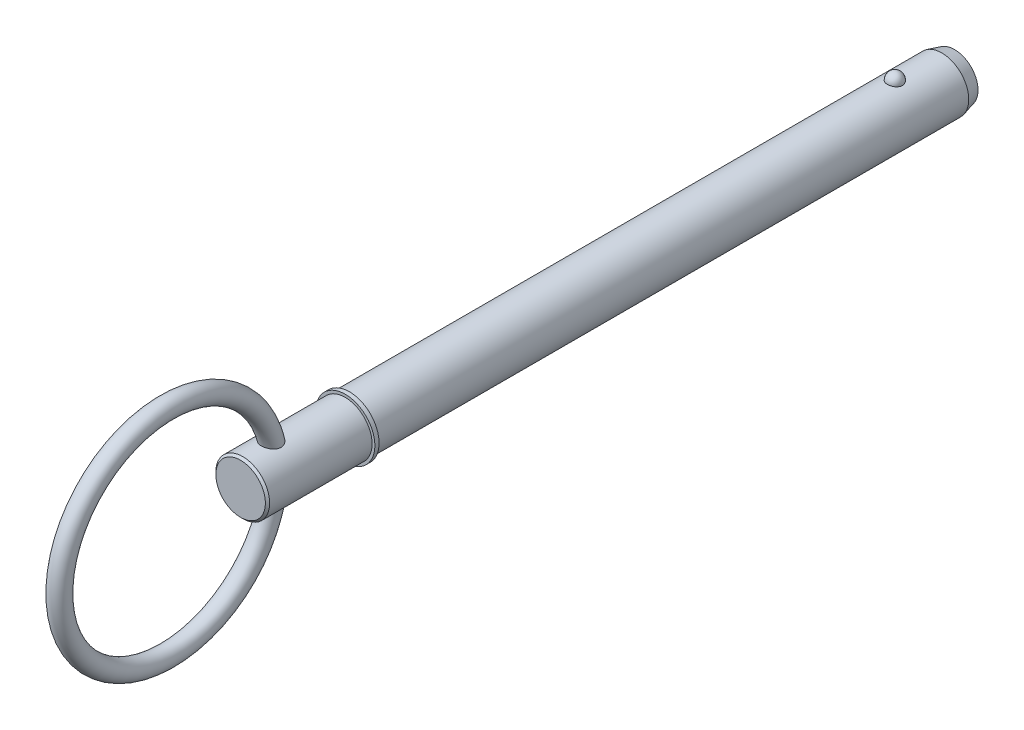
ISO-10303-21;
HEADER;
FILE_DESCRIPTION(('STEP AP214'),'2;1');
FILE_NAME('part.step','',(''),(''),'','','');
FILE_SCHEMA(('AUTOMOTIVE_DESIGN { 1 0 10303 214 1 1 1 1 }'));
ENDSEC;
DATA;
#1=APPLICATION_CONTEXT('core data for automotive mechanical design processes');
#2=APPLICATION_PROTOCOL_DEFINITION('international standard','automotive_design',2000,#1);
#3=PRODUCT_CONTEXT('',#1,'mechanical');
#4=PRODUCT('Part','Part','',(#3));
#5=PRODUCT_RELATED_PRODUCT_CATEGORY('part','',(#4));
#6=PRODUCT_DEFINITION_FORMATION('','',#4);
#7=PRODUCT_DEFINITION_CONTEXT('part definition',#1,'design');
#8=PRODUCT_DEFINITION('design','',#6,#7);
#9=PRODUCT_DEFINITION_SHAPE('','',#8);
#10=(LENGTH_UNIT() NAMED_UNIT(*) SI_UNIT(.MILLI.,.METRE.));
#11=(NAMED_UNIT(*) PLANE_ANGLE_UNIT() SI_UNIT($,.RADIAN.));
#12=(NAMED_UNIT(*) SI_UNIT($,.STERADIAN.) SOLID_ANGLE_UNIT());
#13=UNCERTAINTY_MEASURE_WITH_UNIT(LENGTH_MEASURE(1.E-05),#10,'distance_accuracy_value','');
#14=(GEOMETRIC_REPRESENTATION_CONTEXT(3) GLOBAL_UNCERTAINTY_ASSIGNED_CONTEXT((#13)) GLOBAL_UNIT_ASSIGNED_CONTEXT((#10,
#11,#12)) REPRESENTATION_CONTEXT('',''));
#15=CARTESIAN_POINT('',(0.,0.,0.));
#16=DIRECTION('',(0.,0.,1.));
#17=DIRECTION('',(1.,0.,0.));
#18=AXIS2_PLACEMENT_3D('',#15,#16,#17);
#19=CARTESIAN_POINT('',(0.,0.,127.));
#20=DIRECTION('',(0.,0.,-1.));
#21=DIRECTION('',(-1.,0.,0.));
#22=AXIS2_PLACEMENT_3D('',#19,#20,#21);
#23=CYLINDRICAL_SURFACE('',#22,6.35);
#24=CARTESIAN_POINT('',(1.76243001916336,6.10051968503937,-1.78));
#25=CARTESIAN_POINT('',(1.76242835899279,6.10052111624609,-1.68050311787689));
#26=CARTESIAN_POINT('',(1.75431593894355,6.1028816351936,-1.58098521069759));
#27=CARTESIAN_POINT('',(1.72206027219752,6.11206037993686,-1.38476972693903));
#28=CARTESIAN_POINT('',(1.69791106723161,6.11888026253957,-1.28807321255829));
#29=CARTESIAN_POINT('',(1.63419596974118,6.13620287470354,-1.10029899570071));
#30=CARTESIAN_POINT('',(1.59463684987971,6.14670398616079,-1.00921884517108));
#31=CARTESIAN_POINT('',(1.50108569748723,6.17021534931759,-0.83516140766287));
#32=CARTESIAN_POINT('',(1.44709398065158,6.18322554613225,-0.752183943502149));
#33=CARTESIAN_POINT('',(1.3257243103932,6.21038081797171,-0.596209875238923));
#34=CARTESIAN_POINT('',(1.2582815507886,6.22453118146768,-0.523264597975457));
#35=CARTESIAN_POINT('',(1.11191624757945,6.25233390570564,-0.389855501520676));
#36=CARTESIAN_POINT('',(1.03299369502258,6.26598626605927,-0.329391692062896));
#37=CARTESIAN_POINT('',(0.866022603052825,6.29123226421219,-0.222793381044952));
#38=CARTESIAN_POINT('',(0.778000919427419,6.30283170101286,-0.176618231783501));
#39=CARTESIAN_POINT('',(0.59510847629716,6.32272058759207,-0.0996905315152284));
#40=CARTESIAN_POINT('',(0.500238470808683,6.33101040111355,-0.0689362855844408));
#41=CARTESIAN_POINT('',(0.308164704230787,6.34323464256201,-0.024159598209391));
#42=CARTESIAN_POINT('',(0.211033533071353,6.34724467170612,-0.00984637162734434));
#43=CARTESIAN_POINT('',(0.0156629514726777,6.3507318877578,0.00262058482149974));
#44=CARTESIAN_POINT('',(-0.0825763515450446,6.35020951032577,0.000775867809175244));
#45=CARTESIAN_POINT('',(-0.275890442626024,6.34473055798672,-0.0188727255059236));
#46=CARTESIAN_POINT('',(-0.370990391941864,6.3398374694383,-0.0364481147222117));
#47=CARTESIAN_POINT('',(-0.556805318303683,6.32622723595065,-0.0867447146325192));
#48=CARTESIAN_POINT('',(-0.647520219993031,6.31751002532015,-0.119466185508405));
#49=CARTESIAN_POINT('',(-0.822606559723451,6.29711353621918,-0.199386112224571));
#50=CARTESIAN_POINT('',(-0.906938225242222,6.28541739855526,-0.246667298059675));
#51=CARTESIAN_POINT('',(-1.06646479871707,6.26032612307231,-0.354365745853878));
#52=CARTESIAN_POINT('',(-1.14165877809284,6.24693081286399,-0.41478434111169));
#53=CARTESIAN_POINT('',(-1.2823514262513,6.21959142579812,-0.548435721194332));
#54=CARTESIAN_POINT('',(-1.34763761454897,6.2056417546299,-0.621891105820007));
#55=CARTESIAN_POINT('',(-1.4651153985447,6.17896241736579,-0.778815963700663));
#56=CARTESIAN_POINT('',(-1.51730606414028,6.16623283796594,-0.862286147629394));
#57=CARTESIAN_POINT('',(-1.60782211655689,6.14325839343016,-1.03799158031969));
#58=CARTESIAN_POINT('',(-1.64598111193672,6.13304379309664,-1.13031660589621));
#59=CARTESIAN_POINT('',(-1.70661885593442,6.11644899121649,-1.32030667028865));
#60=CARTESIAN_POINT('',(-1.72909805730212,6.11006867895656,-1.41797155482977));
#61=CARTESIAN_POINT('',(-1.75775019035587,6.1018881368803,-1.61543246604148));
#62=CARTESIAN_POINT('',(-1.76399136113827,6.10006874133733,-1.71521779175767));
#63=CARTESIAN_POINT('',(-1.76020715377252,6.10116172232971,-1.91445126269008));
#64=CARTESIAN_POINT('',(-1.75018221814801,6.10407397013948,-2.01389941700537));
#65=CARTESIAN_POINT('',(-1.71421005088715,6.11427232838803,-2.20912106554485));
#66=CARTESIAN_POINT('',(-1.68834262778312,6.12153651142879,-2.30491043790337));
#67=CARTESIAN_POINT('',(-1.62139543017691,6.1396067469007,-2.49066180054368));
#68=CARTESIAN_POINT('',(-1.5803150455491,6.15041294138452,-2.58062355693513));
#69=CARTESIAN_POINT('',(-1.48369112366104,6.17443456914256,-2.75271428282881));
#70=CARTESIAN_POINT('',(-1.42806998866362,6.18766281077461,-2.83479789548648));
#71=CARTESIAN_POINT('',(-1.30386620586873,6.21501934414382,-2.98832532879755));
#72=CARTESIAN_POINT('',(-1.23528306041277,6.22914767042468,-3.05976874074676));
#73=CARTESIAN_POINT('',(-1.08663999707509,6.25679135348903,-3.19029656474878));
#74=CARTESIAN_POINT('',(-1.00653826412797,6.27030422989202,-3.24933392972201));
#75=CARTESIAN_POINT('',(-0.837212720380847,6.29514770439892,-3.35304657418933));
#76=CARTESIAN_POINT('',(-0.747989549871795,6.30647845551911,-3.39772286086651));
#77=CARTESIAN_POINT('',(-0.564098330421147,6.32556124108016,-3.47096393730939));
#78=CARTESIAN_POINT('',(-0.469512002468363,6.33335611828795,-3.49972259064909));
#79=CARTESIAN_POINT('',(-0.27663389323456,6.34470628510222,-3.54113722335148));
#80=CARTESIAN_POINT('',(-0.17834256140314,6.34826208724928,-3.55379514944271));
#81=CARTESIAN_POINT('',(0.0171660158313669,6.35071525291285,-3.56255473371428));
#82=CARTESIAN_POINT('',(0.114368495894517,6.34969931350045,-3.55896450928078));
#83=CARTESIAN_POINT('',(0.306746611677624,6.34331695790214,-3.53603383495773));
#84=CARTESIAN_POINT('',(0.401922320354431,6.33795069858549,-3.51669395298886));
#85=CARTESIAN_POINT('',(0.587203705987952,6.32347219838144,-3.4629173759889));
#86=CARTESIAN_POINT('',(0.677327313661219,6.31437430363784,-3.42853846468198));
#87=CARTESIAN_POINT('',(0.850462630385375,6.29339543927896,-3.34564128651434));
#88=CARTESIAN_POINT('',(0.933473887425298,6.2815142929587,-3.29712212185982));
#89=CARTESIAN_POINT('',(1.09144542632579,6.25601750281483,-3.18638742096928));
#90=CARTESIAN_POINT('',(1.16626195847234,6.24237795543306,-3.12397237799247));
#91=CARTESIAN_POINT('',(1.304448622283,6.21497285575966,-2.98755865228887));
#92=CARTESIAN_POINT('',(1.36781676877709,6.20120728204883,-2.91355796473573));
#93=CARTESIAN_POINT('',(1.48252779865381,6.17479923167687,-2.75456133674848));
#94=CARTESIAN_POINT('',(1.53364167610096,6.16218052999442,-2.66939613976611));
#95=CARTESIAN_POINT('',(1.62109397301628,6.13975602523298,-2.49147502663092));
#96=CARTESIAN_POINT('',(1.657437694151,6.12994921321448,-2.39872184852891));
#97=CARTESIAN_POINT('',(1.71127844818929,6.11512175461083,-2.21887622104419));
#98=CARTESIAN_POINT('',(1.73042646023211,6.10968903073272,-2.13230770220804));
#99=CARTESIAN_POINT('',(1.75600284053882,6.10238739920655,-1.95716498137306));
#100=CARTESIAN_POINT('',(1.76243149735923,6.10051841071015,-1.86859082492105));
#101=CARTESIAN_POINT('',(1.76243001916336,6.10051968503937,-1.78));
#102=B_SPLINE_CURVE_WITH_KNOTS('',3,(#24,#25,#26,#27,#28,#29,#30,#31,#32,#33,#34,#35,#36,#37,
#38,#39,#40,#41,#42,#43,#44,#45,#46,#47,#48,#49,#50,#51,#52,#53,#54,#55,#56,#57,#58,#59,#60,#61,
#62,#63,#64,#65,#66,#67,#68,#69,#70,#71,#72,#73,#74,#75,#76,#77,#78,#79,#80,#81,#82,#83,#84,#85,
#86,#87,#88,#89,#90,#91,#92,#93,#94,#95,#96,#97,#98,#99,#100,#101),.UNSPECIFIED.,.T.,.F.,(4,2,2,
2,2,2,2,2,2,2,2,2,2,2,2,2,2,2,2,2,2,2,2,2,2,2,2,2,2,2,2,2,2,2,2,2,2,2,4),(0.,0.298172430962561,
0.596455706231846,0.894608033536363,1.19275383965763,1.49237238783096,1.79199116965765,
2.09074960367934,2.38947519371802,2.68283180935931,2.97616022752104,3.26529599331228,
3.5544367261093,3.84525169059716,4.13609618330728,4.43249276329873,4.72891038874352,
5.02873757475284,5.32855610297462,5.62711261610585,5.92566100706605,6.22271765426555,
6.519786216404,6.81847366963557,7.11717259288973,7.41698459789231,7.71677557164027,
8.01283014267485,8.30884891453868,8.59927798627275,8.88969658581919,9.17900899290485,
9.46833977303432,9.76212836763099,10.0559678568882,10.3549321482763,10.6537890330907,
10.9192841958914,11.1847733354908),.UNSPECIFIED.);
#103=CARTESIAN_POINT('',(1.76243001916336,6.10051968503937,-1.78));
#104=VERTEX_POINT('',#103);
#105=EDGE_CURVE('E102',#104,#104,#102,.T.);
#106=ORIENTED_EDGE('',*,*,#105,.T.);
#107=EDGE_LOOP('',(#106));
#108=FACE_BOUND('',#107,.T.);
#109=CARTESIAN_POINT('',(0.,0.,-12.8799999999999));
#110=DIRECTION('',(0.,0.,-1.));
#111=DIRECTION('',(-1.,0.,0.));
#112=AXIS2_PLACEMENT_3D('',#109,#110,#111);
#113=CIRCLE('',#112,6.35);
#114=CARTESIAN_POINT('',(-6.35,0.,-12.8799999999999));
#115=VERTEX_POINT('',#114);
#116=EDGE_CURVE('E110',#115,#115,#113,.F.);
#117=ORIENTED_EDGE('',*,*,#116,.T.);
#118=EDGE_LOOP('',(#117));
#119=FACE_BOUND('',#118,.T.);
#120=CARTESIAN_POINT('',(0.,0.,127.));
#121=DIRECTION('',(0.,0.,1.));
#122=DIRECTION('',(1.,0.,0.));
#123=AXIS2_PLACEMENT_3D('',#120,#121,#122);
#124=CIRCLE('',#123,6.35);
#125=CARTESIAN_POINT('',(6.35,0.,127.));
#126=VERTEX_POINT('',#125);
#127=EDGE_CURVE('E108',#126,#126,#124,.T.);
#128=ORIENTED_EDGE('',*,*,#127,.F.);
#129=EDGE_LOOP('',(#128));
#130=FACE_BOUND('',#129,.T.);
#131=ADVANCED_FACE('F39',(#108,#119,#130),#23,.T.);
#132=CARTESIAN_POINT('',(0.,0.,-15.88));
#133=DIRECTION('',(0.,0.,-1.));
#134=DIRECTION('',(-1.,0.,0.));
#135=AXIS2_PLACEMENT_3D('',#132,#133,#134);
#136=PLANE('',#135);
#137=CARTESIAN_POINT('',(0.,0.,-15.88));
#138=DIRECTION('',(0.,0.,-1.));
#139=DIRECTION('',(-1.,0.,0.));
#140=AXIS2_PLACEMENT_3D('',#137,#138,#139);
#141=CIRCLE('',#140,5.54615242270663);
#142=CARTESIAN_POINT('',(-5.54615242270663,0.,-15.88));
#143=VERTEX_POINT('',#142);
#144=EDGE_CURVE('E142',#143,#143,#141,.T.);
#145=ORIENTED_EDGE('',*,*,#144,.T.);
#146=EDGE_LOOP('',(#145));
#147=FACE_BOUND('',#146,.T.);
#148=ADVANCED_FACE('F88',(#147),#136,.T.);
#149=CARTESIAN_POINT('',(0.,0.,-15.88));
#150=DIRECTION('',(0.,0.,1.));
#151=DIRECTION('',(1.,0.,0.));
#152=AXIS2_PLACEMENT_3D('',#149,#150,#151);
#153=CONICAL_SURFACE('',#152,5.54615242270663,0.261799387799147);
#154=ORIENTED_EDGE('',*,*,#116,.F.);
#155=EDGE_LOOP('',(#154));
#156=FACE_BOUND('',#155,.T.);
#157=ORIENTED_EDGE('',*,*,#144,.F.);
#158=EDGE_LOOP('',(#157));
#159=FACE_BOUND('',#158,.T.);
#160=ADVANCED_FACE('F94',(#156,#159),#153,.T.);
#161=CARTESIAN_POINT('',(0.,6.35,-1.78));
#162=DIRECTION('',(0.,1.,0.));
#163=DIRECTION('',(0.,0.,-1.));
#164=AXIS2_PLACEMENT_3D('',#161,#162,#163);
#165=SPHERICAL_SURFACE('',#164,1.78);
#166=ORIENTED_EDGE('',*,*,#105,.F.);
#167=EDGE_LOOP('',(#166));
#168=FACE_BOUND('',#167,.T.);
#169=ADVANCED_FACE('F113',(#168),#165,.T.);
#170=CARTESIAN_POINT('',(0.,0.,127.));
#171=DIRECTION('',(0.,0.,-1.));
#172=DIRECTION('',(-1.,0.,0.));
#173=AXIS2_PLACEMENT_3D('',#170,#171,#172);
#174=PLANE('',#173);
#175=ORIENTED_EDGE('',*,*,#127,.T.);
#176=EDGE_LOOP('',(#175));
#177=FACE_BOUND('',#176,.T.);
#178=CARTESIAN_POINT('',(0.,0.,127.));
#179=DIRECTION('',(0.,0.,-1.));
#180=DIRECTION('',(-1.,0.,0.));
#181=AXIS2_PLACEMENT_3D('',#178,#179,#180);
#182=CIRCLE('',#181,7.);
#183=CARTESIAN_POINT('',(-7.,0.,127.));
#184=VERTEX_POINT('',#183);
#185=EDGE_CURVE('E109',#184,#184,#182,.T.);
#186=ORIENTED_EDGE('',*,*,#185,.T.);
#187=EDGE_LOOP('',(#186));
#188=FACE_BOUND('',#187,.T.);
#189=ADVANCED_FACE('F117',(#177,#188),#174,.T.);
#190=CARTESIAN_POINT('',(0.,0.,33.7287874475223));
#191=DIRECTION('',(0.,0.,-1.));
#192=DIRECTION('',(-1.,0.,0.));
#193=AXIS2_PLACEMENT_3D('',#190,#191,#192);
#194=CYLINDRICAL_SURFACE('',#193,7.);
#195=CARTESIAN_POINT('',(0.,0.,128.));
#196=DIRECTION('',(0.,0.,-1.));
#197=DIRECTION('',(-1.,0.,0.));
#198=AXIS2_PLACEMENT_3D('',#195,#196,#197);
#199=CIRCLE('',#198,7.);
#200=CARTESIAN_POINT('',(-7.,0.,128.));
#201=VERTEX_POINT('',#200);
#202=EDGE_CURVE('E134',#201,#201,#199,.T.);
#203=ORIENTED_EDGE('',*,*,#202,.T.);
#204=EDGE_LOOP('',(#203));
#205=FACE_BOUND('',#204,.T.);
#206=ORIENTED_EDGE('',*,*,#185,.F.);
#207=EDGE_LOOP('',(#206));
#208=FACE_BOUND('',#207,.T.);
#209=ADVANCED_FACE('F121',(#205,#208),#194,.T.);
#210=CARTESIAN_POINT('',(0.,7.,128.));
#211=DIRECTION('',(0.,0.,1.));
#212=DIRECTION('',(1.,0.,0.));
#213=AXIS2_PLACEMENT_3D('',#210,#211,#212);
#214=PLANE('',#213);
#215=CARTESIAN_POINT('',(0.,0.,128.));
#216=DIRECTION('',(0.,0.,1.));
#217=DIRECTION('',(1.,0.,0.));
#218=AXIS2_PLACEMENT_3D('',#215,#216,#217);
#219=CIRCLE('',#218,6.35);
#220=CARTESIAN_POINT('',(6.35,0.,128.));
#221=VERTEX_POINT('',#220);
#222=EDGE_CURVE('E112',#221,#221,#219,.T.);
#223=ORIENTED_EDGE('',*,*,#222,.F.);
#224=EDGE_LOOP('',(#223));
#225=FACE_BOUND('',#224,.T.);
#226=ORIENTED_EDGE('',*,*,#202,.F.);
#227=EDGE_LOOP('',(#226));
#228=FACE_BOUND('',#227,.T.);
#229=ADVANCED_FACE('F85',(#225,#228),#214,.T.);
#230=CARTESIAN_POINT('',(0.,0.,152.7));
#231=DIRECTION('',(0.,0.,-1.));
#232=DIRECTION('',(-1.,0.,0.));
#233=AXIS2_PLACEMENT_3D('',#230,#231,#232);
#234=CYLINDRICAL_SURFACE('',#233,6.35);
#235=CARTESIAN_POINT('',(-1.08120660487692,-6.25727514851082,143.45158117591));
#236=CARTESIAN_POINT('',(-0.970724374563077,-6.27636409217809,143.393879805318));
#237=CARTESIAN_POINT('',(-0.855136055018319,-6.29329984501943,143.345219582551));
#238=CARTESIAN_POINT('',(-0.616958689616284,-6.32109419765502,143.26705594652));
#239=CARTESIAN_POINT('',(-0.494369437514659,-6.3319526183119,143.23755309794));
#240=CARTESIAN_POINT('',(-0.245606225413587,-6.34647141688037,143.198367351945));
#241=CARTESIAN_POINT('',(-0.119431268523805,-6.35012977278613,143.188690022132));
#242=CARTESIAN_POINT('',(0.132849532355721,-6.34986313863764,143.189400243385));
#243=CARTESIAN_POINT('',(0.258955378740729,-6.34593843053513,143.199787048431));
#244=CARTESIAN_POINT('',(0.506912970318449,-6.33094785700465,143.240285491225));
#245=CARTESIAN_POINT('',(0.628781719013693,-6.31991516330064,143.270305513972));
#246=CARTESIAN_POINT('',(0.865486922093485,-6.29187143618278,143.349308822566));
#247=CARTESIAN_POINT('',(0.980322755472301,-6.27485987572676,143.398293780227));
#248=CARTESIAN_POINT('',(1.20050616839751,-6.23649440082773,143.514540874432));
#249=CARTESIAN_POINT('',(1.30578867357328,-6.2151135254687,143.581917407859));
#250=CARTESIAN_POINT('',(1.50311440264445,-6.17036440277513,143.733359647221));
#251=CARTESIAN_POINT('',(1.5951571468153,-6.14699608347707,143.817425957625));
#252=CARTESIAN_POINT('',(1.76326863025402,-6.10090072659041,144.000247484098));
#253=CARTESIAN_POINT('',(1.83935482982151,-6.07817301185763,144.098986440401));
#254=CARTESIAN_POINT('',(1.97338559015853,-6.03599268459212,144.308703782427));
#255=CARTESIAN_POINT('',(2.03133638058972,-6.01653894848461,144.419677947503));
#256=CARTESIAN_POINT('',(2.1259120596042,-5.98376466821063,144.647018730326));
#257=CARTESIAN_POINT('',(2.16315310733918,-5.97026970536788,144.763104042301));
#258=CARTESIAN_POINT('',(2.21830650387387,-5.94999923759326,145.000318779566));
#259=CARTESIAN_POINT('',(2.2362211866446,-5.94322292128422,145.121447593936));
#260=CARTESIAN_POINT('',(2.25273772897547,-5.93698111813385,145.363281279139));
#261=CARTESIAN_POINT('',(2.25163224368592,-5.93740484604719,145.483964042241));
#262=CARTESIAN_POINT('',(2.23167546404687,-5.94493297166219,145.723620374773));
#263=CARTESIAN_POINT('',(2.21281883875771,-5.9520393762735,145.842593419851));
#264=CARTESIAN_POINT('',(2.15679576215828,-5.97257680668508,146.083836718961));
#265=CARTESIAN_POINT('',(2.1185113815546,-5.98639144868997,146.20581287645));
#266=CARTESIAN_POINT('',(2.024702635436,-6.01876484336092,146.442284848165));
#267=CARTESIAN_POINT('',(1.96916879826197,-6.03732620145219,146.556776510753));
#268=CARTESIAN_POINT('',(1.83526629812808,-6.07945247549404,146.787995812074));
#269=CARTESIAN_POINT('',(1.75507038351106,-6.10334207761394,146.903611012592));
#270=CARTESIAN_POINT('',(1.5765788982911,-6.15186551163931,147.119894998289));
#271=CARTESIAN_POINT('',(1.47827192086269,-6.17649980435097,147.220554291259));
#272=CARTESIAN_POINT('',(1.26306696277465,-6.22410762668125,147.405023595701));
#273=CARTESIAN_POINT('',(1.14585214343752,-6.2470408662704,147.488478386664));
#274=CARTESIAN_POINT('',(0.896825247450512,-6.28760987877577,147.631400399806));
#275=CARTESIAN_POINT('',(0.765036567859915,-6.30525397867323,147.690905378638));
#276=CARTESIAN_POINT('',(0.509454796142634,-6.330648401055,147.775263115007));
#277=CARTESIAN_POINT('',(0.386964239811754,-6.33940909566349,147.803695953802));
#278=CARTESIAN_POINT('',(0.200813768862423,-6.3471308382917,147.828680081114));
#279=CARTESIAN_POINT('',(0.138353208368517,-6.34880140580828,147.834063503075));
#280=CARTESIAN_POINT('',(0.0131841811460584,-6.35029448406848,147.83887386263));
#281=CARTESIAN_POINT('',(-0.0495242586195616,-6.35011719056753,147.838301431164));
#282=CARTESIAN_POINT('',(-0.219860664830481,-6.34710452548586,147.828597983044));
#283=CARTESIAN_POINT('',(-0.327176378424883,-6.34243953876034,147.813576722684));
#284=CARTESIAN_POINT('',(-0.537619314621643,-6.32808248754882,147.766673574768));
#285=CARTESIAN_POINT('',(-0.640746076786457,-6.31838987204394,147.734789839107));
#286=CARTESIAN_POINT('',(-0.841795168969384,-6.29478075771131,147.655337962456));
#287=CARTESIAN_POINT('',(-0.939631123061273,-6.28081033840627,147.60756888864));
#288=CARTESIAN_POINT('',(-1.12690564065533,-6.2499288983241,147.498513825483));
#289=CARTESIAN_POINT('',(-1.21634109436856,-6.2330167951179,147.437222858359));
#290=CARTESIAN_POINT('',(-1.39713031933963,-6.19517308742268,147.294039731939));
#291=CARTESIAN_POINT('',(-1.48711596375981,-6.17400700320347,147.210483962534));
#292=CARTESIAN_POINT('',(-1.65373642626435,-6.13148145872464,147.030996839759));
#293=CARTESIAN_POINT('',(-1.73036130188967,-6.11012186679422,146.93505636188));
#294=CARTESIAN_POINT('',(-1.87908981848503,-6.0661652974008,146.718620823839));
#295=CARTESIAN_POINT('',(-1.94902044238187,-6.04382072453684,146.596572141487));
#296=CARTESIAN_POINT('',(-2.06849605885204,-6.00398244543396,146.342070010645));
#297=CARTESIAN_POINT('',(-2.11803457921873,-5.98649027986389,146.209613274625));
#298=CARTESIAN_POINT('',(-2.19551930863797,-5.95851933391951,145.934593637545));
#299=CARTESIAN_POINT('',(-2.22297667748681,-5.94819998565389,145.791874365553));
#300=CARTESIAN_POINT('',(-2.25222139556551,-5.93719450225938,145.503480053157));
#301=CARTESIAN_POINT('',(-2.25403508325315,-5.93649848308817,145.357808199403));
#302=CARTESIAN_POINT('',(-2.23178480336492,-5.94489150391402,145.083804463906));
#303=CARTESIAN_POINT('',(-2.21035650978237,-5.95298402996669,144.955226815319));
#304=CARTESIAN_POINT('',(-2.14565882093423,-5.97660650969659,144.70440891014));
#305=CARTESIAN_POINT('',(-2.10239634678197,-5.99213410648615,144.582166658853));
#306=CARTESIAN_POINT('',(-1.99913159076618,-6.02732890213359,144.356747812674));
#307=CARTESIAN_POINT('',(-1.94060271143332,-6.0466053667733,144.252829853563));
#308=CARTESIAN_POINT('',(-1.80736340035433,-6.0877569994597,144.056534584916));
#309=CARTESIAN_POINT('',(-1.73265259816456,-6.10963222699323,143.964157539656));
#310=CARTESIAN_POINT('',(-1.56865095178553,-6.15378470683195,143.792603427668));
#311=CARTESIAN_POINT('',(-1.47928749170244,-6.17606344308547,143.713496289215));
#312=CARTESIAN_POINT('',(-1.28858731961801,-6.21864788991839,143.570675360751));
#313=CARTESIAN_POINT('',(-1.18724893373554,-6.23895332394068,143.506963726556));
#314=CARTESIAN_POINT('',(-1.08120660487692,-6.25727514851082,143.45158117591));
#315=B_SPLINE_CURVE_WITH_KNOTS('',3,(#235,#236,#237,#238,#239,#240,#241,#242,#243,#244,#245,
#246,#247,#248,#249,#250,#251,#252,#253,#254,#255,#256,#257,#258,#259,#260,#261,#262,#263,#264,
#265,#266,#267,#268,#269,#270,#271,#272,#273,#274,#275,#276,#277,#278,#279,#280,#281,#282,#283,
#284,#285,#286,#287,#288,#289,#290,#291,#292,#293,#294,#295,#296,#297,#298,#299,#300,#301,#302,
#303,#304,#305,#306,#307,#308,#309,#310,#311,#312,#313,#314),.UNSPECIFIED.,.T.,.F.,(4,2,2,2,2,2,
2,2,2,2,2,2,2,2,2,2,2,2,2,2,2,2,2,2,2,2,2,2,2,2,2,2,2,2,2,2,2,2,2,4),(0.,0.377861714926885,
0.755734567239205,1.13371352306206,1.51167842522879,1.88789208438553,2.26413891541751,
2.64278156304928,3.02143792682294,3.3996777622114,3.77778752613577,4.14394628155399,
4.51006081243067,4.87054720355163,5.23114188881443,5.61534494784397,5.99975934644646,
6.42600522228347,6.8525204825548,7.28711365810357,7.72101899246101,8.09666132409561,
8.28452949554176,8.47237776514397,8.7960795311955,9.11981678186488,9.44781545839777,
9.77593508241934,10.1483085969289,10.5209580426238,10.9463240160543,11.3718248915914,
11.8065046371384,12.240737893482,12.6304236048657,13.0199858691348,13.3807583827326,
13.7415391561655,14.104165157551,14.4668419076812),.UNSPECIFIED.);
#316=CARTESIAN_POINT('',(-1.08120660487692,-6.25727514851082,143.45158117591));
#317=VERTEX_POINT('',#316);
#318=EDGE_CURVE('E10',#317,#317,#315,.T.);
#319=ORIENTED_EDGE('',*,*,#318,.F.);
#320=EDGE_LOOP('',(#319));
#321=FACE_BOUND('',#320,.T.);
#322=CARTESIAN_POINT('',(-1.08120660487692,6.25727514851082,143.45158117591));
#323=CARTESIAN_POINT('',(-1.19093168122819,6.23831652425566,143.508887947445));
#324=CARTESIAN_POINT('',(-1.29562751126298,6.21723224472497,143.575116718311));
#325=CARTESIAN_POINT('',(-1.49211272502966,6.17302620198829,143.724020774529));
#326=CARTESIAN_POINT('',(-1.58390200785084,6.14990442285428,143.806696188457));
#327=CARTESIAN_POINT('',(-1.75209695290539,6.10411985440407,143.986777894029));
#328=CARTESIAN_POINT('',(-1.82848346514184,6.08145766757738,144.084202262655));
#329=CARTESIAN_POINT('',(-1.96346259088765,6.03923311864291,144.291273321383));
#330=CARTESIAN_POINT('',(-2.02206050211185,6.01966983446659,144.400916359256));
#331=CARTESIAN_POINT('',(-2.11860444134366,5.9863659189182,144.626564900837));
#332=CARTESIAN_POINT('',(-2.15701637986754,5.97249571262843,144.742351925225));
#333=CARTESIAN_POINT('',(-2.21449304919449,5.95142584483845,144.979191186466));
#334=CARTESIAN_POINT('',(-2.23356015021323,5.94422536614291,145.100242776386));
#335=CARTESIAN_POINT('',(-2.25228141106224,5.93715610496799,145.341944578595));
#336=CARTESIAN_POINT('',(-2.25225786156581,5.93716560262,145.462567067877));
#337=CARTESIAN_POINT('',(-2.2344206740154,5.94389982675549,145.702277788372));
#338=CARTESIAN_POINT('',(-2.21660184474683,5.95062651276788,145.821365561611));
#339=CARTESIAN_POINT('',(-2.16272689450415,5.97042554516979,146.062705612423));
#340=CARTESIAN_POINT('',(-2.12559286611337,5.98387086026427,146.184684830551));
#341=CARTESIAN_POINT('',(-2.03409944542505,6.01558578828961,146.421342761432));
#342=CARTESIAN_POINT('',(-1.97973080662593,6.03385799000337,146.536017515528));
#343=CARTESIAN_POINT('',(-1.84828023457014,6.07549301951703,146.767865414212));
#344=CARTESIAN_POINT('',(-1.76936622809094,6.09919386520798,146.883943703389));
#345=CARTESIAN_POINT('',(-1.59344783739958,6.14749881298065,147.101420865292));
#346=CARTESIAN_POINT('',(-1.49643151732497,6.17210350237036,147.202809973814));
#347=CARTESIAN_POINT('',(-1.28333318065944,6.21994692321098,147.389508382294));
#348=CARTESIAN_POINT('',(-1.1668572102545,6.24314005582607,147.4743845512));
#349=CARTESIAN_POINT('',(-0.919062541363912,6.2843871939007,147.62034404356));
#350=CARTESIAN_POINT('',(-0.78776676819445,6.30244898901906,147.681463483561));
#351=CARTESIAN_POINT('',(-0.532335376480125,6.32876911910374,147.76911129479));
#352=CARTESIAN_POINT('',(-0.409516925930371,6.33800211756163,147.799123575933));
#353=CARTESIAN_POINT('',(-0.222636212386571,6.34640533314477,147.826338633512));
#354=CARTESIAN_POINT('',(-0.159893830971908,6.34829860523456,147.832442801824));
#355=CARTESIAN_POINT('',(-0.0340877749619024,6.35021985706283,147.83863417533));
#356=CARTESIAN_POINT('',(0.0289758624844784,6.35024804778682,147.83872206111));
#357=CARTESIAN_POINT('',(0.200008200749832,6.34776620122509,147.830732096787));
#358=CARTESIAN_POINT('',(0.307730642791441,6.34342046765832,147.81675007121));
#359=CARTESIAN_POINT('',(0.51913450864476,6.32963338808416,147.771765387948));
#360=CARTESIAN_POINT('',(0.622815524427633,6.3201915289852,147.740761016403));
#361=CARTESIAN_POINT('',(0.824580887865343,6.2970603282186,147.663086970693));
#362=CARTESIAN_POINT('',(0.922611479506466,6.28333629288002,147.616289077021));
#363=CARTESIAN_POINT('',(1.11039970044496,6.2528858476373,147.509122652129));
#364=CARTESIAN_POINT('',(1.20015435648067,6.23615836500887,147.448749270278));
#365=CARTESIAN_POINT('',(1.38155818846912,6.19866747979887,147.30760245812));
#366=CARTESIAN_POINT('',(1.47187645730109,6.17766310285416,147.225184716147));
#367=CARTESIAN_POINT('',(1.63933626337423,6.13535258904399,147.047946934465));
#368=CARTESIAN_POINT('',(1.71646809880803,6.11404624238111,146.953117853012));
#369=CARTESIAN_POINT('',(1.86660460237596,6.07002946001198,146.738851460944));
#370=CARTESIAN_POINT('',(1.93743710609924,6.04755477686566,146.617834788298));
#371=CARTESIAN_POINT('',(2.05894300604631,6.00727604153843,146.365280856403));
#372=CARTESIAN_POINT('',(2.10960917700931,5.98947366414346,146.233739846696));
#373=CARTESIAN_POINT('',(2.18982014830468,5.96062717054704,145.959758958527));
#374=CARTESIAN_POINT('',(2.21877575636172,5.94977267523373,145.817123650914));
#375=CARTESIAN_POINT('',(2.25104759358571,5.93764416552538,145.528595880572));
#376=CARTESIAN_POINT('',(2.25438985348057,5.93636042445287,145.382706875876));
#377=CARTESIAN_POINT('',(2.23498011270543,5.94368858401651,145.107731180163));
#378=CARTESIAN_POINT('',(2.21482640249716,5.95131530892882,144.978434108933));
#379=CARTESIAN_POINT('',(2.15248760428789,5.97414352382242,144.725969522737));
#380=CARTESIAN_POINT('',(2.11031020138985,5.98934237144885,144.602799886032));
#381=CARTESIAN_POINT('',(2.00904610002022,6.02402214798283,144.375783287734));
#382=CARTESIAN_POINT('',(1.95150192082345,6.04308594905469,144.271178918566));
#383=CARTESIAN_POINT('',(1.82009972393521,6.08395083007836,144.073382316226));
#384=CARTESIAN_POINT('',(1.74624088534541,6.10575204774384,143.980190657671));
#385=CARTESIAN_POINT('',(1.58309476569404,6.15008431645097,143.806164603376));
#386=CARTESIAN_POINT('',(1.49360904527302,6.17262128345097,143.725518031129));
#387=CARTESIAN_POINT('',(1.30231515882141,6.21579297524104,143.579836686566));
#388=CARTESIAN_POINT('',(1.20050521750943,6.23642742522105,143.51480416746));
#389=CARTESIAN_POINT('',(0.983786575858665,6.27432316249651,143.3998596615));
#390=CARTESIAN_POINT('',(0.868563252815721,6.29145558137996,143.350497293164));
#391=CARTESIAN_POINT('',(0.630994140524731,6.31970327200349,143.270885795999));
#392=CARTESIAN_POINT('',(0.508648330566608,6.33081852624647,143.240636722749));
#393=CARTESIAN_POINT('',(0.259933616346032,6.34590352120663,143.199879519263));
#394=CARTESIAN_POINT('',(0.133554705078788,6.34985380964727,143.189425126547));
#395=CARTESIAN_POINT('',(-0.119270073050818,6.35013815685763,143.188667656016));
#396=CARTESIAN_POINT('',(-0.245715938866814,6.34647233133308,143.198364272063));
#397=CARTESIAN_POINT('',(-0.494670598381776,6.33192772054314,143.237620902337));
#398=CARTESIAN_POINT('',(-0.617189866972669,6.3210701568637,143.267122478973));
#399=CARTESIAN_POINT('',(-0.855240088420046,6.29328476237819,143.345263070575));
#400=CARTESIAN_POINT('',(-0.970770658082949,6.27635659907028,143.393903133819));
#401=CARTESIAN_POINT('',(-1.08120660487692,6.25727514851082,143.45158117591));
#402=B_SPLINE_CURVE_WITH_KNOTS('',3,(#322,#323,#324,#325,#326,#327,#328,#329,#330,#331,#332,
#333,#334,#335,#336,#337,#338,#339,#340,#341,#342,#343,#344,#345,#346,#347,#348,#349,#350,#351,
#352,#353,#354,#355,#356,#357,#358,#359,#360,#361,#362,#363,#364,#365,#366,#367,#368,#369,#370,
#371,#372,#373,#374,#375,#376,#377,#378,#379,#380,#381,#382,#383,#384,#385,#386,#387,#388,#389,
#390,#391,#392,#393,#394,#395,#396,#397,#398,#399,#400,#401),.UNSPECIFIED.,.T.,.F.,(4,2,2,2,2,2,
2,2,2,2,2,2,2,2,2,2,2,2,2,2,2,2,2,2,2,2,2,2,2,2,2,2,2,2,2,2,2,2,2,4),(0.,0.375258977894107,
0.750520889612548,1.12624651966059,1.50186014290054,1.86837438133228,2.23484370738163,
2.59512638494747,2.95551419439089,3.33859924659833,3.7218901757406,4.14704029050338,
4.57247172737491,5.00788576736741,5.44263524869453,5.82040093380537,6.00932292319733,
6.19822354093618,6.52266071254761,6.8471305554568,7.17430063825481,7.50158780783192,
7.87233275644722,8.24334931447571,8.66748794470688,9.09177840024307,9.52720369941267,
9.96218641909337,10.3532895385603,10.7442562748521,11.1052784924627,11.4663188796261,
11.8323306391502,12.1983951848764,12.5761580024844,12.9539219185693,13.3327099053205,
13.7114921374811,14.0891615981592,14.4668517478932),.UNSPECIFIED.);
#403=CARTESIAN_POINT('',(-1.08120660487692,6.25727514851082,143.45158117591));
#404=VERTEX_POINT('',#403);
#405=EDGE_CURVE('E51',#404,#404,#402,.T.);
#406=ORIENTED_EDGE('',*,*,#405,.F.);
#407=EDGE_LOOP('',(#406));
#408=FACE_BOUND('',#407,.T.);
#409=CARTESIAN_POINT('',(0.,0.,152.2));
#410=DIRECTION('',(0.,0.,-1.));
#411=DIRECTION('',(-1.,0.,0.));
#412=AXIS2_PLACEMENT_3D('',#409,#410,#411);
#413=CIRCLE('',#412,6.35);
#414=CARTESIAN_POINT('',(-6.35,0.,152.2));
#415=VERTEX_POINT('',#414);
#416=EDGE_CURVE('E64',#415,#415,#413,.T.);
#417=ORIENTED_EDGE('',*,*,#416,.T.);
#418=EDGE_LOOP('',(#417));
#419=FACE_BOUND('',#418,.T.);
#420=ORIENTED_EDGE('',*,*,#222,.T.);
#421=EDGE_LOOP('',(#420));
#422=FACE_BOUND('',#421,.T.);
#423=ADVANCED_FACE('F69',(#321,#408,#419,#422),#234,.T.);
#424=CARTESIAN_POINT('',(0.,0.,152.7));
#425=DIRECTION('',(0.,0.,-1.));
#426=DIRECTION('',(-1.,0.,0.));
#427=AXIS2_PLACEMENT_3D('',#424,#425,#426);
#428=PLANE('',#427);
#429=CARTESIAN_POINT('',(0.,0.,152.7));
#430=DIRECTION('',(0.,0.,-1.));
#431=DIRECTION('',(-1.,0.,0.));
#432=AXIS2_PLACEMENT_3D('',#429,#430,#431);
#433=CIRCLE('',#432,5.84999999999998);
#434=CARTESIAN_POINT('',(-5.84999999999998,0.,152.7));
#435=VERTEX_POINT('',#434);
#436=EDGE_CURVE('E58',#435,#435,#433,.F.);
#437=ORIENTED_EDGE('',*,*,#436,.T.);
#438=EDGE_LOOP('',(#437));
#439=FACE_BOUND('',#438,.T.);
#440=ADVANCED_FACE('F76',(#439),#428,.F.);
#441=CARTESIAN_POINT('',(0.,0.,152.2));
#442=DIRECTION('',(0.,0.,-1.));
#443=DIRECTION('',(-1.,0.,0.));
#444=AXIS2_PLACEMENT_3D('',#441,#442,#443);
#445=CONICAL_SURFACE('',#444,6.35,0.785398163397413);
#446=ORIENTED_EDGE('',*,*,#436,.F.);
#447=EDGE_LOOP('',(#446));
#448=FACE_BOUND('',#447,.T.);
#449=ORIENTED_EDGE('',*,*,#416,.F.);
#450=EDGE_LOOP('',(#449));
#451=FACE_BOUND('',#450,.T.);
#452=ADVANCED_FACE('F41',(#448,#451),#445,.T.);
#453=CARTESIAN_POINT('',(0.,0.,170.1));
#454=DIRECTION('',(1.,0.,0.));
#455=DIRECTION('',(0.,0.,-1.));
#456=AXIS2_PLACEMENT_3D('',#453,#454,#455);
#457=TOROIDAL_SURFACE('',#456,25.4,2.25);
#458=ORIENTED_EDGE('',*,*,#318,.T.);
#459=EDGE_LOOP('',(#458));
#460=FACE_BOUND('',#459,.T.);
#461=ORIENTED_EDGE('',*,*,#405,.T.);
#462=EDGE_LOOP('',(#461));
#463=FACE_BOUND('',#462,.T.);
#464=ADVANCED_FACE('F73',(#460,#463),#457,.T.);
#465=CLOSED_SHELL('',(#131,#148,#160,#169,#189,#209,#229,#423,#440,#452,#464));
#466=MANIFOLD_SOLID_BREP('B2',#465);
#467=ADVANCED_BREP_SHAPE_REPRESENTATION('',(#18,#466),#14);
#468=SHAPE_DEFINITION_REPRESENTATION(#9,#467);
ENDSEC;
END-ISO-10303-21;
